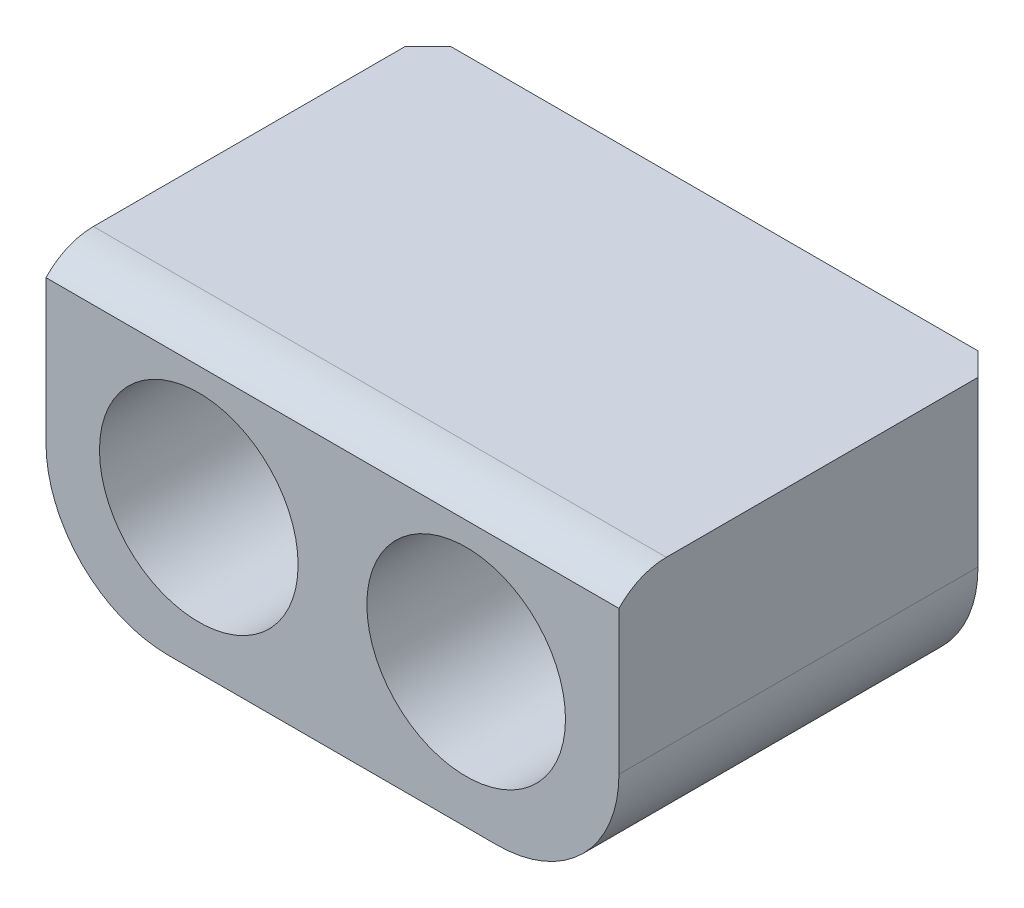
ISO-10303-21;
HEADER;
FILE_DESCRIPTION(('STEP AP214'),'2;1');
FILE_NAME('part.step','',(''),(''),'','','');
FILE_SCHEMA(('AUTOMOTIVE_DESIGN { 1 0 10303 214 1 1 1 1 }'));
ENDSEC;
DATA;
#1=APPLICATION_CONTEXT('core data for automotive mechanical design processes');
#2=APPLICATION_PROTOCOL_DEFINITION('international standard','automotive_design',2000,#1);
#3=PRODUCT_CONTEXT('',#1,'mechanical');
#4=PRODUCT('Part','Part','',(#3));
#5=PRODUCT_RELATED_PRODUCT_CATEGORY('part','',(#4));
#6=PRODUCT_DEFINITION_FORMATION('','',#4);
#7=PRODUCT_DEFINITION_CONTEXT('part definition',#1,'design');
#8=PRODUCT_DEFINITION('design','',#6,#7);
#9=PRODUCT_DEFINITION_SHAPE('','',#8);
#10=(LENGTH_UNIT() NAMED_UNIT(*) SI_UNIT(.MILLI.,.METRE.));
#11=(NAMED_UNIT(*) PLANE_ANGLE_UNIT() SI_UNIT($,.RADIAN.));
#12=(NAMED_UNIT(*) SI_UNIT($,.STERADIAN.) SOLID_ANGLE_UNIT());
#13=UNCERTAINTY_MEASURE_WITH_UNIT(LENGTH_MEASURE(1.E-05),#10,'distance_accuracy_value','');
#14=(GEOMETRIC_REPRESENTATION_CONTEXT(3) GLOBAL_UNCERTAINTY_ASSIGNED_CONTEXT((#13)) GLOBAL_UNIT_ASSIGNED_CONTEXT((#10,
#11,#12)) REPRESENTATION_CONTEXT('',''));
#15=CARTESIAN_POINT('',(0.,0.,0.));
#16=DIRECTION('',(0.,0.,1.));
#17=DIRECTION('',(1.,0.,0.));
#18=AXIS2_PLACEMENT_3D('',#15,#16,#17);
#19=CARTESIAN_POINT('',(0.,0.,-12.7));
#20=DIRECTION('',(-1.,0.,0.));
#21=DIRECTION('',(0.,-1.,0.));
#22=AXIS2_PLACEMENT_3D('',#19,#20,#21);
#23=PLANE('',#22);
#24=DIRECTION('',(0.,0.,1.));
#25=VECTOR('',#24,1.);
#26=CARTESIAN_POINT('',(0.,0.,-12.7));
#27=LINE('',#26,#25);
#28=CARTESIAN_POINT('',(0.,0.,-11.938));
#29=VERTEX_POINT('',#28);
#30=CARTESIAN_POINT('',(0.,0.,-1.5748));
#31=VERTEX_POINT('',#30);
#32=EDGE_CURVE('E126',#29,#31,#27,.T.);
#33=ORIENTED_EDGE('',*,*,#32,.F.);
#34=DIRECTION('',(0.,-1.,0.));
#35=VECTOR('',#34,1.);
#36=CARTESIAN_POINT('',(0.,-5.461,-11.938));
#37=LINE('',#36,#35);
#38=CARTESIAN_POINT('',(0.,-5.461,-11.938));
#39=VERTEX_POINT('',#38);
#40=EDGE_CURVE('E191',#29,#39,#37,.T.);
#41=ORIENTED_EDGE('',*,*,#40,.T.);
#42=DIRECTION('',(0.,0.,1.));
#43=VECTOR('',#42,1.);
#44=CARTESIAN_POINT('',(0.,-5.461,-12.7));
#45=LINE('',#44,#43);
#46=CARTESIAN_POINT('',(0.,-5.461,0.));
#47=VERTEX_POINT('',#46);
#48=EDGE_CURVE('E178',#39,#47,#45,.T.);
#49=ORIENTED_EDGE('',*,*,#48,.T.);
#50=DIRECTION('',(0.,-1.,0.));
#51=VECTOR('',#50,1.);
#52=CARTESIAN_POINT('',(0.,0.,0.));
#53=LINE('',#52,#51);
#54=CARTESIAN_POINT('',(0.,-0.685077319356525,0.));
#55=VERTEX_POINT('',#54);
#56=EDGE_CURVE('E169',#55,#47,#53,.T.);
#57=ORIENTED_EDGE('',*,*,#56,.F.);
#58=CARTESIAN_POINT('',(0.,-2.1525497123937,-1.5748));
#59=DIRECTION('',(1.,0.,0.));
#60=DIRECTION('',(0.,1.,0.));
#61=AXIS2_PLACEMENT_3D('',#58,#59,#60);
#62=CIRCLE('',#61,2.15254971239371);
#63=EDGE_CURVE('E136',#31,#55,#62,.T.);
#64=ORIENTED_EDGE('',*,*,#63,.F.);
#65=EDGE_LOOP('',(#33,#41,#49,#57,#64));
#66=FACE_BOUND('',#65,.T.);
#67=ADVANCED_FACE('F37',(#66),#23,.T.);
#68=CARTESIAN_POINT('',(0.,0.,-12.7));
#69=DIRECTION('',(0.,1.,0.));
#70=DIRECTION('',(0.,0.,1.));
#71=AXIS2_PLACEMENT_3D('',#68,#69,#70);
#72=PLANE('',#71);
#73=DIRECTION('',(-1.,0.,0.));
#74=VECTOR('',#73,1.);
#75=CARTESIAN_POINT('',(0.,0.,-12.7));
#76=LINE('',#75,#74);
#77=CARTESIAN_POINT('',(18.288,0.,-12.7));
#78=VERTEX_POINT('',#77);
#79=CARTESIAN_POINT('',(0.762000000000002,0.,-12.7));
#80=VERTEX_POINT('',#79);
#81=EDGE_CURVE('E127',#78,#80,#76,.T.);
#82=ORIENTED_EDGE('',*,*,#81,.T.);
#83=DIRECTION('',(-0.707106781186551,0.,0.707106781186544));
#84=VECTOR('',#83,1.);
#85=CARTESIAN_POINT('',(0.380999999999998,0.,-12.319));
#86=LINE('',#85,#84);
#87=EDGE_CURVE('E206',#80,#29,#86,.T.);
#88=ORIENTED_EDGE('',*,*,#87,.T.);
#89=ORIENTED_EDGE('',*,*,#32,.T.);
#90=DIRECTION('',(-1.,0.,0.));
#91=VECTOR('',#90,1.);
#92=CARTESIAN_POINT('',(19.05,0.,-1.5748));
#93=LINE('',#92,#91);
#94=CARTESIAN_POINT('',(19.05,0.,-1.5748));
#95=VERTEX_POINT('',#94);
#96=EDGE_CURVE('E132',#95,#31,#93,.T.);
#97=ORIENTED_EDGE('',*,*,#96,.F.);
#98=DIRECTION('',(0.,0.,1.));
#99=VECTOR('',#98,1.);
#100=CARTESIAN_POINT('',(19.05,0.,-12.7));
#101=LINE('',#100,#99);
#102=CARTESIAN_POINT('',(19.05,0.,-11.938));
#103=VERTEX_POINT('',#102);
#104=EDGE_CURVE('E116',#103,#95,#101,.T.);
#105=ORIENTED_EDGE('',*,*,#104,.F.);
#106=DIRECTION('',(-0.707106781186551,0.,-0.707106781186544));
#107=VECTOR('',#106,1.);
#108=CARTESIAN_POINT('',(9.14399999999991,0.,-21.844));
#109=LINE('',#108,#107);
#110=EDGE_CURVE('E204',#103,#78,#109,.T.);
#111=ORIENTED_EDGE('',*,*,#110,.T.);
#112=EDGE_LOOP('',(#82,#88,#89,#97,#105,#111));
#113=FACE_BOUND('',#112,.T.);
#114=ADVANCED_FACE('F139',(#113),#72,.T.);
#115=CARTESIAN_POINT('',(19.05,0.,-12.7));
#116=DIRECTION('',(1.,0.,0.));
#117=DIRECTION('',(0.,1.,0.));
#118=AXIS2_PLACEMENT_3D('',#115,#116,#117);
#119=PLANE('',#118);
#120=DIRECTION('',(0.,0.,1.));
#121=VECTOR('',#120,1.);
#122=CARTESIAN_POINT('',(19.05,-5.461,-12.7));
#123=LINE('',#122,#121);
#124=CARTESIAN_POINT('',(19.05,-5.461,0.));
#125=VERTEX_POINT('',#124);
#126=CARTESIAN_POINT('',(19.05,-5.461,-11.938));
#127=VERTEX_POINT('',#126);
#128=EDGE_CURVE('E189',#125,#127,#123,.F.);
#129=ORIENTED_EDGE('',*,*,#128,.T.);
#130=DIRECTION('',(0.,1.,0.));
#131=VECTOR('',#130,1.);
#132=CARTESIAN_POINT('',(19.05,0.,-11.938));
#133=LINE('',#132,#131);
#134=EDGE_CURVE('E11',#127,#103,#133,.T.);
#135=ORIENTED_EDGE('',*,*,#134,.T.);
#136=ORIENTED_EDGE('',*,*,#104,.T.);
#137=CARTESIAN_POINT('',(19.05,-2.15254971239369,-1.5748));
#138=DIRECTION('',(1.,0.,0.));
#139=DIRECTION('',(0.,1.,0.));
#140=AXIS2_PLACEMENT_3D('',#137,#138,#139);
#141=CIRCLE('',#140,2.15254971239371);
#142=CARTESIAN_POINT('',(19.05,-0.685077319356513,0.));
#143=VERTEX_POINT('',#142);
#144=EDGE_CURVE('E120',#95,#143,#141,.T.);
#145=ORIENTED_EDGE('',*,*,#144,.T.);
#146=DIRECTION('',(0.,1.,0.));
#147=VECTOR('',#146,1.);
#148=CARTESIAN_POINT('',(19.05,0.,0.));
#149=LINE('',#148,#147);
#150=EDGE_CURVE('E171',#125,#143,#149,.T.);
#151=ORIENTED_EDGE('',*,*,#150,.F.);
#152=EDGE_LOOP('',(#129,#135,#136,#145,#151));
#153=FACE_BOUND('',#152,.T.);
#154=ADVANCED_FACE('F118',(#153),#119,.T.);
#155=CARTESIAN_POINT('',(0.,-9.525,-12.7));
#156=DIRECTION('',(0.,-1.,0.));
#157=DIRECTION('',(0.,0.,-1.));
#158=AXIS2_PLACEMENT_3D('',#155,#156,#157);
#159=PLANE('',#158);
#160=DIRECTION('',(0.,0.,1.));
#161=VECTOR('',#160,1.);
#162=CARTESIAN_POINT('',(4.064,-9.525,-12.7));
#163=LINE('',#162,#161);
#164=CARTESIAN_POINT('',(4.064,-9.525,0.));
#165=VERTEX_POINT('',#164);
#166=CARTESIAN_POINT('',(4.064,-9.525,-11.938));
#167=VERTEX_POINT('',#166);
#168=EDGE_CURVE('E187',#165,#167,#163,.F.);
#169=ORIENTED_EDGE('',*,*,#168,.T.);
#170=DIRECTION('',(1.,0.,0.));
#171=VECTOR('',#170,1.);
#172=CARTESIAN_POINT('',(14.986,-9.525,-11.938));
#173=LINE('',#172,#171);
#174=CARTESIAN_POINT('',(14.986,-9.525,-11.938));
#175=VERTEX_POINT('',#174);
#176=EDGE_CURVE('E61',#167,#175,#173,.T.);
#177=ORIENTED_EDGE('',*,*,#176,.T.);
#178=DIRECTION('',(0.,0.,1.));
#179=VECTOR('',#178,1.);
#180=CARTESIAN_POINT('',(14.986,-9.525,-12.7));
#181=LINE('',#180,#179);
#182=CARTESIAN_POINT('',(14.986,-9.525,0.));
#183=VERTEX_POINT('',#182);
#184=EDGE_CURVE('E185',#175,#183,#181,.T.);
#185=ORIENTED_EDGE('',*,*,#184,.T.);
#186=DIRECTION('',(1.,0.,0.));
#187=VECTOR('',#186,1.);
#188=CARTESIAN_POINT('',(0.,-9.525,0.));
#189=LINE('',#188,#187);
#190=EDGE_CURVE('E174',#165,#183,#189,.T.);
#191=ORIENTED_EDGE('',*,*,#190,.F.);
#192=EDGE_LOOP('',(#169,#177,#185,#191));
#193=FACE_BOUND('',#192,.T.);
#194=ADVANCED_FACE('F238',(#193),#159,.T.);
#195=CARTESIAN_POINT('',(0.,-9.525,-12.7));
#196=DIRECTION('',(0.,0.,1.));
#197=DIRECTION('',(1.,0.,0.));
#198=AXIS2_PLACEMENT_3D('',#195,#196,#197);
#199=PLANE('',#198);
#200=CARTESIAN_POINT('',(5.08,-4.7625,-12.7));
#201=DIRECTION('',(0.,0.,1.));
#202=DIRECTION('',(1.,0.,0.));
#203=AXIS2_PLACEMENT_3D('',#200,#201,#202);
#204=CIRCLE('',#203,2.159);
#205=CARTESIAN_POINT('',(7.239,-4.7625,-12.7));
#206=VERTEX_POINT('',#205);
#207=EDGE_CURVE('E154',#206,#206,#204,.T.);
#208=ORIENTED_EDGE('',*,*,#207,.T.);
#209=EDGE_LOOP('',(#208));
#210=FACE_BOUND('',#209,.T.);
#211=CARTESIAN_POINT('',(13.97,-4.7625,-12.7));
#212=DIRECTION('',(0.,0.,1.));
#213=DIRECTION('',(1.,0.,0.));
#214=AXIS2_PLACEMENT_3D('',#211,#212,#213);
#215=CIRCLE('',#214,2.159);
#216=CARTESIAN_POINT('',(16.129,-4.7625,-12.7));
#217=VERTEX_POINT('',#216);
#218=EDGE_CURVE('E166',#217,#217,#215,.T.);
#219=ORIENTED_EDGE('',*,*,#218,.T.);
#220=EDGE_LOOP('',(#219));
#221=FACE_BOUND('',#220,.T.);
#222=CARTESIAN_POINT('',(4.064,-5.461,-12.7));
#223=DIRECTION('',(0.,0.,1.));
#224=DIRECTION('',(1.,0.,0.));
#225=AXIS2_PLACEMENT_3D('',#222,#223,#224);
#226=CIRCLE('',#225,3.302);
#227=CARTESIAN_POINT('',(4.064,-8.763,-12.7));
#228=VERTEX_POINT('',#227);
#229=CARTESIAN_POINT('',(0.762000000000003,-5.461,-12.7));
#230=VERTEX_POINT('',#229);
#231=EDGE_CURVE('E200',#228,#230,#226,.F.);
#232=ORIENTED_EDGE('',*,*,#231,.T.);
#233=DIRECTION('',(0.,1.,0.));
#234=VECTOR('',#233,1.);
#235=CARTESIAN_POINT('',(0.762000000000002,0.,-12.7));
#236=LINE('',#235,#234);
#237=EDGE_CURVE('E202',#230,#80,#236,.T.);
#238=ORIENTED_EDGE('',*,*,#237,.T.);
#239=ORIENTED_EDGE('',*,*,#81,.F.);
#240=DIRECTION('',(0.,-1.,0.));
#241=VECTOR('',#240,1.);
#242=CARTESIAN_POINT('',(18.288,-5.461,-12.7));
#243=LINE('',#242,#241);
#244=CARTESIAN_POINT('',(18.288,-5.461,-12.7));
#245=VERTEX_POINT('',#244);
#246=EDGE_CURVE('E194',#78,#245,#243,.T.);
#247=ORIENTED_EDGE('',*,*,#246,.T.);
#248=CARTESIAN_POINT('',(14.986,-5.461,-12.7));
#249=DIRECTION('',(0.,0.,1.));
#250=DIRECTION('',(1.,0.,0.));
#251=AXIS2_PLACEMENT_3D('',#248,#249,#250);
#252=CIRCLE('',#251,3.302);
#253=CARTESIAN_POINT('',(14.986,-8.763,-12.7));
#254=VERTEX_POINT('',#253);
#255=EDGE_CURVE('E196',#245,#254,#252,.F.);
#256=ORIENTED_EDGE('',*,*,#255,.T.);
#257=DIRECTION('',(-1.,0.,0.));
#258=VECTOR('',#257,1.);
#259=CARTESIAN_POINT('',(4.064,-8.763,-12.7));
#260=LINE('',#259,#258);
#261=EDGE_CURVE('E198',#254,#228,#260,.T.);
#262=ORIENTED_EDGE('',*,*,#261,.T.);
#263=EDGE_LOOP('',(#232,#238,#239,#247,#256,#262));
#264=FACE_BOUND('',#263,.T.);
#265=ADVANCED_FACE('F246',(#210,#221,#264),#199,.F.);
#266=CARTESIAN_POINT('',(0.,-9.525,0.));
#267=DIRECTION('',(0.,0.,1.));
#268=DIRECTION('',(1.,0.,0.));
#269=AXIS2_PLACEMENT_3D('',#266,#267,#268);
#270=PLANE('',#269);
#271=DIRECTION('',(-1.,0.,0.));
#272=VECTOR('',#271,1.);
#273=CARTESIAN_POINT('',(19.05,-0.685077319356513,0.));
#274=LINE('',#273,#272);
#275=EDGE_CURVE('E135',#143,#55,#274,.T.);
#276=ORIENTED_EDGE('',*,*,#275,.T.);
#277=ORIENTED_EDGE('',*,*,#56,.T.);
#278=CARTESIAN_POINT('',(4.064,-5.461,0.));
#279=DIRECTION('',(0.,0.,1.));
#280=DIRECTION('',(1.,0.,0.));
#281=AXIS2_PLACEMENT_3D('',#278,#279,#280);
#282=CIRCLE('',#281,4.064);
#283=EDGE_CURVE('E183',#47,#165,#282,.T.);
#284=ORIENTED_EDGE('',*,*,#283,.T.);
#285=ORIENTED_EDGE('',*,*,#190,.T.);
#286=CARTESIAN_POINT('',(14.986,-5.461,0.));
#287=DIRECTION('',(0.,0.,1.));
#288=DIRECTION('',(1.,0.,0.));
#289=AXIS2_PLACEMENT_3D('',#286,#287,#288);
#290=CIRCLE('',#289,4.064);
#291=EDGE_CURVE('E181',#183,#125,#290,.T.);
#292=ORIENTED_EDGE('',*,*,#291,.T.);
#293=ORIENTED_EDGE('',*,*,#150,.T.);
#294=EDGE_LOOP('',(#276,#277,#284,#285,#292,#293));
#295=FACE_BOUND('',#294,.T.);
#296=CARTESIAN_POINT('',(5.08,-4.7625,0.));
#297=DIRECTION('',(0.,0.,1.));
#298=DIRECTION('',(1.,0.,0.));
#299=AXIS2_PLACEMENT_3D('',#296,#297,#298);
#300=CIRCLE('',#299,3.302);
#301=CARTESIAN_POINT('',(8.382,-4.7625,0.));
#302=VERTEX_POINT('',#301);
#303=EDGE_CURVE('E142',#302,#302,#300,.T.);
#304=ORIENTED_EDGE('',*,*,#303,.F.);
#305=EDGE_LOOP('',(#304));
#306=FACE_BOUND('',#305,.T.);
#307=CARTESIAN_POINT('',(13.97,-4.7625,0.));
#308=DIRECTION('',(0.,0.,1.));
#309=DIRECTION('',(1.,0.,0.));
#310=AXIS2_PLACEMENT_3D('',#307,#308,#309);
#311=CIRCLE('',#310,3.302);
#312=CARTESIAN_POINT('',(17.272,-4.7625,0.));
#313=VERTEX_POINT('',#312);
#314=EDGE_CURVE('E157',#313,#313,#311,.T.);
#315=ORIENTED_EDGE('',*,*,#314,.F.);
#316=EDGE_LOOP('',(#315));
#317=FACE_BOUND('',#316,.T.);
#318=ADVANCED_FACE('F228',(#295,#306,#317),#270,.T.);
#319=CARTESIAN_POINT('',(4.064,-5.461,-12.7));
#320=DIRECTION('',(0.,0.,1.));
#321=DIRECTION('',(1.,0.,0.));
#322=AXIS2_PLACEMENT_3D('',#319,#320,#321);
#323=CYLINDRICAL_SURFACE('',#322,4.064);
#324=ORIENTED_EDGE('',*,*,#48,.F.);
#325=CARTESIAN_POINT('',(4.064,-5.461,-11.938));
#326=DIRECTION('',(0.,0.,1.));
#327=DIRECTION('',(1.,0.,0.));
#328=AXIS2_PLACEMENT_3D('',#325,#326,#327);
#329=CIRCLE('',#328,4.064);
#330=EDGE_CURVE('E208',#39,#167,#329,.T.);
#331=ORIENTED_EDGE('',*,*,#330,.T.);
#332=ORIENTED_EDGE('',*,*,#168,.F.);
#333=ORIENTED_EDGE('',*,*,#283,.F.);
#334=EDGE_LOOP('',(#324,#331,#332,#333));
#335=FACE_BOUND('',#334,.T.);
#336=ADVANCED_FACE('F234',(#335),#323,.T.);
#337=CARTESIAN_POINT('',(14.986,-5.461,-12.7));
#338=DIRECTION('',(0.,0.,1.));
#339=DIRECTION('',(1.,0.,0.));
#340=AXIS2_PLACEMENT_3D('',#337,#338,#339);
#341=CYLINDRICAL_SURFACE('',#340,4.064);
#342=ORIENTED_EDGE('',*,*,#184,.F.);
#343=CARTESIAN_POINT('',(14.986,-5.461,-11.938));
#344=DIRECTION('',(0.,0.,1.));
#345=DIRECTION('',(1.,0.,0.));
#346=AXIS2_PLACEMENT_3D('',#343,#344,#345);
#347=CIRCLE('',#346,4.064);
#348=EDGE_CURVE('E46',#175,#127,#347,.T.);
#349=ORIENTED_EDGE('',*,*,#348,.T.);
#350=ORIENTED_EDGE('',*,*,#128,.F.);
#351=ORIENTED_EDGE('',*,*,#291,.F.);
#352=EDGE_LOOP('',(#342,#349,#350,#351));
#353=FACE_BOUND('',#352,.T.);
#354=ADVANCED_FACE('F240',(#353),#341,.T.);
#355=CARTESIAN_POINT('',(13.97,-4.7625,0.));
#356=DIRECTION('',(0.,0.,1.));
#357=DIRECTION('',(1.,0.,0.));
#358=AXIS2_PLACEMENT_3D('',#355,#356,#357);
#359=CYLINDRICAL_SURFACE('',#358,2.159);
#360=ORIENTED_EDGE('',*,*,#218,.F.);
#361=EDGE_LOOP('',(#360));
#362=FACE_BOUND('',#361,.T.);
#363=CARTESIAN_POINT('',(13.97,-4.7625,-4.826));
#364=DIRECTION('',(0.,0.,1.));
#365=DIRECTION('',(1.,0.,0.));
#366=AXIS2_PLACEMENT_3D('',#363,#364,#365);
#367=CIRCLE('',#366,2.159);
#368=CARTESIAN_POINT('',(16.129,-4.7625,-4.826));
#369=VERTEX_POINT('',#368);
#370=EDGE_CURVE('E163',#369,#369,#367,.T.);
#371=ORIENTED_EDGE('',*,*,#370,.T.);
#372=EDGE_LOOP('',(#371));
#373=FACE_BOUND('',#372,.T.);
#374=ADVANCED_FACE('F276',(#362,#373),#359,.F.);
#375=CARTESIAN_POINT('',(16.129,-4.7625,-4.826));
#376=DIRECTION('',(0.,0.,-1.));
#377=DIRECTION('',(-1.,0.,0.));
#378=AXIS2_PLACEMENT_3D('',#375,#376,#377);
#379=PLANE('',#378);
#380=ORIENTED_EDGE('',*,*,#370,.F.);
#381=EDGE_LOOP('',(#380));
#382=FACE_BOUND('',#381,.T.);
#383=CARTESIAN_POINT('',(13.97,-4.7625,-4.826));
#384=DIRECTION('',(0.,0.,1.));
#385=DIRECTION('',(1.,0.,0.));
#386=AXIS2_PLACEMENT_3D('',#383,#384,#385);
#387=CIRCLE('',#386,3.302);
#388=CARTESIAN_POINT('',(17.272,-4.7625,-4.826));
#389=VERTEX_POINT('',#388);
#390=EDGE_CURVE('E160',#389,#389,#387,.T.);
#391=ORIENTED_EDGE('',*,*,#390,.T.);
#392=EDGE_LOOP('',(#391));
#393=FACE_BOUND('',#392,.T.);
#394=ADVANCED_FACE('F369',(#382,#393),#379,.F.);
#395=CARTESIAN_POINT('',(13.97,-4.7625,0.));
#396=DIRECTION('',(0.,0.,1.));
#397=DIRECTION('',(1.,0.,0.));
#398=AXIS2_PLACEMENT_3D('',#395,#396,#397);
#399=CYLINDRICAL_SURFACE('',#398,3.302);
#400=ORIENTED_EDGE('',*,*,#390,.F.);
#401=EDGE_LOOP('',(#400));
#402=FACE_BOUND('',#401,.T.);
#403=ORIENTED_EDGE('',*,*,#314,.T.);
#404=EDGE_LOOP('',(#403));
#405=FACE_BOUND('',#404,.T.);
#406=ADVANCED_FACE('F358',(#402,#405),#399,.F.);
#407=CARTESIAN_POINT('',(5.08,-4.7625,0.));
#408=DIRECTION('',(0.,0.,1.));
#409=DIRECTION('',(1.,0.,0.));
#410=AXIS2_PLACEMENT_3D('',#407,#408,#409);
#411=CYLINDRICAL_SURFACE('',#410,2.159);
#412=ORIENTED_EDGE('',*,*,#207,.F.);
#413=EDGE_LOOP('',(#412));
#414=FACE_BOUND('',#413,.T.);
#415=CARTESIAN_POINT('',(5.08,-4.7625,-4.826));
#416=DIRECTION('',(0.,0.,1.));
#417=DIRECTION('',(1.,0.,0.));
#418=AXIS2_PLACEMENT_3D('',#415,#416,#417);
#419=CIRCLE('',#418,2.159);
#420=CARTESIAN_POINT('',(7.239,-4.7625,-4.826));
#421=VERTEX_POINT('',#420);
#422=EDGE_CURVE('E151',#421,#421,#419,.T.);
#423=ORIENTED_EDGE('',*,*,#422,.T.);
#424=EDGE_LOOP('',(#423));
#425=FACE_BOUND('',#424,.T.);
#426=ADVANCED_FACE('F347',(#414,#425),#411,.F.);
#427=CARTESIAN_POINT('',(7.239,-4.7625,-4.826));
#428=DIRECTION('',(0.,0.,-1.));
#429=DIRECTION('',(-1.,0.,0.));
#430=AXIS2_PLACEMENT_3D('',#427,#428,#429);
#431=PLANE('',#430);
#432=ORIENTED_EDGE('',*,*,#422,.F.);
#433=EDGE_LOOP('',(#432));
#434=FACE_BOUND('',#433,.T.);
#435=CARTESIAN_POINT('',(5.08,-4.7625,-4.826));
#436=DIRECTION('',(0.,0.,1.));
#437=DIRECTION('',(1.,0.,0.));
#438=AXIS2_PLACEMENT_3D('',#435,#436,#437);
#439=CIRCLE('',#438,3.302);
#440=CARTESIAN_POINT('',(8.382,-4.7625,-4.826));
#441=VERTEX_POINT('',#440);
#442=EDGE_CURVE('E148',#441,#441,#439,.T.);
#443=ORIENTED_EDGE('',*,*,#442,.T.);
#444=EDGE_LOOP('',(#443));
#445=FACE_BOUND('',#444,.T.);
#446=ADVANCED_FACE('F336',(#434,#445),#431,.F.);
#447=CARTESIAN_POINT('',(5.08,-4.7625,0.));
#448=DIRECTION('',(0.,0.,1.));
#449=DIRECTION('',(1.,0.,0.));
#450=AXIS2_PLACEMENT_3D('',#447,#448,#449);
#451=CYLINDRICAL_SURFACE('',#450,3.302);
#452=ORIENTED_EDGE('',*,*,#442,.F.);
#453=EDGE_LOOP('',(#452));
#454=FACE_BOUND('',#453,.T.);
#455=ORIENTED_EDGE('',*,*,#303,.T.);
#456=EDGE_LOOP('',(#455));
#457=FACE_BOUND('',#456,.T.);
#458=ADVANCED_FACE('F325',(#454,#457),#451,.F.);
#459=CARTESIAN_POINT('',(19.05,-2.15254971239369,-1.5748));
#460=DIRECTION('',(-1.,0.,0.));
#461=DIRECTION('',(0.,-1.,0.));
#462=AXIS2_PLACEMENT_3D('',#459,#460,#461);
#463=CYLINDRICAL_SURFACE('',#462,2.15254971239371);
#464=ORIENTED_EDGE('',*,*,#63,.T.);
#465=ORIENTED_EDGE('',*,*,#275,.F.);
#466=ORIENTED_EDGE('',*,*,#144,.F.);
#467=ORIENTED_EDGE('',*,*,#96,.T.);
#468=EDGE_LOOP('',(#464,#465,#466,#467));
#469=FACE_BOUND('',#468,.T.);
#470=ADVANCED_FACE('F131',(#469),#463,.T.);
#471=CARTESIAN_POINT('',(19.05,0.,-11.938));
#472=DIRECTION('',(0.707106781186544,0.,-0.707106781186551));
#473=DIRECTION('',(0.,-1.,0.));
#474=AXIS2_PLACEMENT_3D('',#471,#472,#473);
#475=PLANE('',#474);
#476=ORIENTED_EDGE('',*,*,#110,.F.);
#477=ORIENTED_EDGE('',*,*,#134,.F.);
#478=DIRECTION('',(0.707106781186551,0.,0.707106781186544));
#479=VECTOR('',#478,1.);
#480=CARTESIAN_POINT('',(18.288,-5.461,-12.7));
#481=LINE('',#480,#479);
#482=EDGE_CURVE('E41',#245,#127,#481,.T.);
#483=ORIENTED_EDGE('',*,*,#482,.F.);
#484=ORIENTED_EDGE('',*,*,#246,.F.);
#485=EDGE_LOOP('',(#476,#477,#483,#484));
#486=FACE_BOUND('',#485,.T.);
#487=ADVANCED_FACE('F39',(#486),#475,.T.);
#488=CARTESIAN_POINT('',(14.986,-5.461,-12.7));
#489=DIRECTION('',(0.,0.,1.));
#490=DIRECTION('',(1.,0.,0.));
#491=AXIS2_PLACEMENT_3D('',#488,#489,#490);
#492=CONICAL_SURFACE('',#491,3.302,0.785398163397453);
#493=ORIENTED_EDGE('',*,*,#482,.T.);
#494=ORIENTED_EDGE('',*,*,#348,.F.);
#495=DIRECTION('',(0.,-0.707106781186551,0.707106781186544));
#496=VECTOR('',#495,1.);
#497=CARTESIAN_POINT('',(14.986,-8.763,-12.7));
#498=LINE('',#497,#496);
#499=EDGE_CURVE('E216',#254,#175,#498,.T.);
#500=ORIENTED_EDGE('',*,*,#499,.F.);
#501=ORIENTED_EDGE('',*,*,#255,.F.);
#502=EDGE_LOOP('',(#493,#494,#500,#501));
#503=FACE_BOUND('',#502,.T.);
#504=ADVANCED_FACE('F256',(#503),#492,.T.);
#505=CARTESIAN_POINT('',(0.,-9.525,-11.938));
#506=DIRECTION('',(0.,-0.707106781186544,-0.707106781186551));
#507=DIRECTION('',(-1.,0.,0.));
#508=AXIS2_PLACEMENT_3D('',#505,#506,#507);
#509=PLANE('',#508);
#510=ORIENTED_EDGE('',*,*,#499,.T.);
#511=ORIENTED_EDGE('',*,*,#176,.F.);
#512=DIRECTION('',(0.,-0.707106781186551,0.707106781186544));
#513=VECTOR('',#512,1.);
#514=CARTESIAN_POINT('',(4.064,-8.763,-12.7));
#515=LINE('',#514,#513);
#516=EDGE_CURVE('E214',#228,#167,#515,.T.);
#517=ORIENTED_EDGE('',*,*,#516,.F.);
#518=ORIENTED_EDGE('',*,*,#261,.F.);
#519=EDGE_LOOP('',(#510,#511,#517,#518));
#520=FACE_BOUND('',#519,.T.);
#521=ADVANCED_FACE('F255',(#520),#509,.T.);
#522=CARTESIAN_POINT('',(4.064,-5.461,-12.7));
#523=DIRECTION('',(0.,0.,1.));
#524=DIRECTION('',(1.,0.,0.));
#525=AXIS2_PLACEMENT_3D('',#522,#523,#524);
#526=CONICAL_SURFACE('',#525,3.302,0.785398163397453);
#527=ORIENTED_EDGE('',*,*,#516,.T.);
#528=ORIENTED_EDGE('',*,*,#330,.F.);
#529=DIRECTION('',(-0.707106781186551,0.,0.707106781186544));
#530=VECTOR('',#529,1.);
#531=CARTESIAN_POINT('',(0.762000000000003,-5.461,-12.7));
#532=LINE('',#531,#530);
#533=EDGE_CURVE('E212',#230,#39,#532,.T.);
#534=ORIENTED_EDGE('',*,*,#533,.F.);
#535=ORIENTED_EDGE('',*,*,#231,.F.);
#536=EDGE_LOOP('',(#527,#528,#534,#535));
#537=FACE_BOUND('',#536,.T.);
#538=ADVANCED_FACE('F253',(#537),#526,.T.);
#539=CARTESIAN_POINT('',(0.,0.,-11.938));
#540=DIRECTION('',(-0.707106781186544,0.,-0.707106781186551));
#541=DIRECTION('',(0.,1.,0.));
#542=AXIS2_PLACEMENT_3D('',#539,#540,#541);
#543=PLANE('',#542);
#544=ORIENTED_EDGE('',*,*,#87,.F.);
#545=ORIENTED_EDGE('',*,*,#237,.F.);
#546=ORIENTED_EDGE('',*,*,#533,.T.);
#547=ORIENTED_EDGE('',*,*,#40,.F.);
#548=EDGE_LOOP('',(#544,#545,#546,#547));
#549=FACE_BOUND('',#548,.T.);
#550=ADVANCED_FACE('F251',(#549),#543,.T.);
#551=CLOSED_SHELL('',(#67,#114,#154,#194,#265,#318,#336,#354,#374,#394,#406,#426,#446,#458,#470,
#487,#504,#521,#538,#550));
#552=MANIFOLD_SOLID_BREP('B2',#551);
#553=ADVANCED_BREP_SHAPE_REPRESENTATION('',(#18,#552),#14);
#554=SHAPE_DEFINITION_REPRESENTATION(#9,#553);
ENDSEC;
END-ISO-10303-21;
